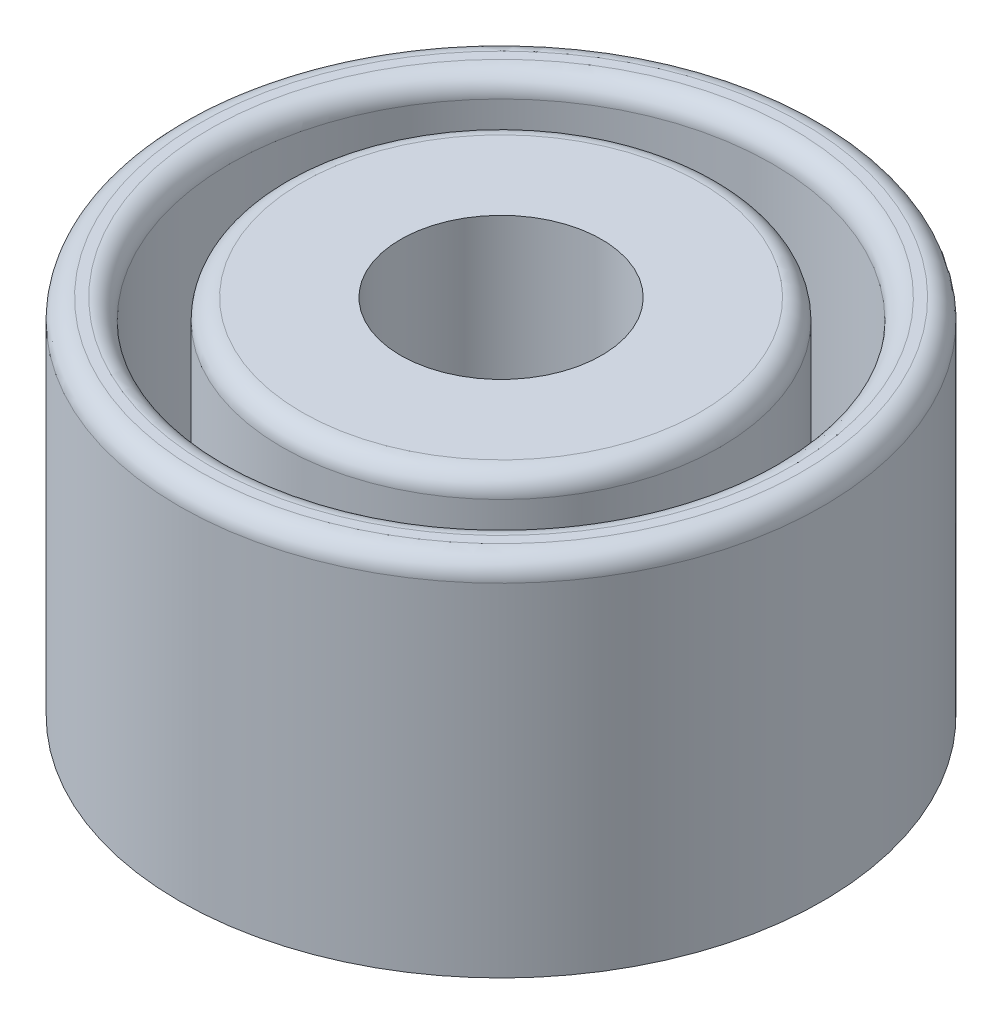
from build123d import *

# Parameters (mm, degrees)
SKETCH_1_R          = 16
EXTRUDE_1_DEPTH     = 18
SKETCH_2_R          = 13.5
SKETCH_2_R_2        = 10.9
SKETCH_2_R_3        = 5
CUT_EXTRUDE_1_DEPTH = 14
CUT_EXTRUDE_2_DEPTH = 1
FILLET_1_R          = 1


with BuildPart() as part:
    # Sketch 1 → Extrude 1 (new body)
    with BuildSketch(Plane(origin=(0, 0, 0), x_dir=(1, 0, 0), z_dir=(0, 1, 0))):
        with Locations(Location((0, 0, 0), (0, 0, 270))):
            Circle(SKETCH_1_R)
    extrude(amount=EXTRUDE_1_DEPTH)

    # Sketch 2 → Cut-Extrude 1 (cut)
    # profile 1 of 2: a face of its own
    with BuildSketch(Plane(origin=(0, 18, 0), x_dir=(1, 0, 0), z_dir=(0, 1, 0))):
        with Locations(Location((0, 0, 0), (0, 0, 270))):
            Circle(SKETCH_2_R)
        with Locations(Location((0, 0, 0), (0, 0, 270))):
            Circle(SKETCH_2_R_2, mode=Mode.SUBTRACT)
    # profile 2 of 2: a face of its own
    with BuildSketch(Plane(origin=(0, 18, 0), x_dir=(1, 0, 0), z_dir=(0, 1, 0))):
        with Locations(Location((0, 0, 0), (0, 0, 270))):
            Circle(SKETCH_2_R_3)
    extrude(amount=-CUT_EXTRUDE_1_DEPTH, mode=Mode.SUBTRACT)

    # Sketch 3 → Cut-Extrude 2 (cut)
    with BuildSketch(Plane.XZ):
        with BuildLine():
            Line((0, -5.25), (0, -6.600740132))
            Line((0, -6.600740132), (-3.769736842, -9.001233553))
            add(Edge.make_bspline(
                [(-3.769736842, -9.001233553), (-3.821474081, -9.033829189), (-3.917540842, -9.094353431), (-4.051706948, -9.176624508), (-4.166594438, -9.240717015), (-4.236771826, -9.277271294), (-4.268092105, -9.293585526)],
                knots=[0, 0, 0, 0, 1.269529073, 2.357287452, 3.266854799, 4, 4, 4, 4], degree=3))
            Line((-4.268092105, -9.293585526), (-4.268092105, -9.309621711))
            add(Edge.make_bspline(
                [(-4.268092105, -9.309621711), (-4.239722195, -9.307146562), (-4.17971652, -9.301911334), (-4.084407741, -9.293770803), (-3.978610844, -9.289964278), (-3.86270089, -9.284435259), (-3.736446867, -9.280864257), (-3.599505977, -9.278909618), (-3.451904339, -9.275594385), (-3.349919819, -9.276070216), (-3.297286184, -9.276315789)],
                knots=[0, 0, 0, 0, 0.703373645, 1.487717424, 2.362034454, 3.317515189, 4.353823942, 5.481267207, 6.700096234, 8, 8, 8, 8], degree=3))
            Line((-3.297286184, -9.276315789), (0, -9.276315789))
            Line((0, -9.276315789), (0, -10.539473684))
            Line((0, -10.539473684), (-6, -10.539473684))
            Line((-6, -10.539473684), (-6, -9.097450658))
            Line((-6, -9.097450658), (-2.347450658, -6.788240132))
            add(Edge.make_bspline(
                [(-2.347450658, -6.788240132), (-2.266014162, -6.737012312), (-2.105045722, -6.635754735), (-1.93951591, -6.542141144), (-1.857730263, -6.495888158)],
                knots=[0, 0, 0, 0, 1.011831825, 2, 2, 2, 2], degree=3))
            Line((-1.857730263, -6.495888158), (-1.857730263, -6.479851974))
            add(Edge.make_bspline(
                [(-1.857730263, -6.479851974), (-1.877460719, -6.482358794), (-1.92056861, -6.487835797), (-1.99201853, -6.495953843), (-2.076078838, -6.499539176), (-2.17305805, -6.505189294), (-2.2820557, -6.508591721), (-2.404193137, -6.510630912), (-2.538637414, -6.51388283), (-2.632810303, -6.513405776), (-2.681743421, -6.513157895)],
                knots=[0, 0, 0, 0, 0.578461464, 1.263845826, 2.090348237, 3.024315, 4.089200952, 5.261350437, 6.576971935, 8, 8, 8, 8], degree=3))
            Line((-2.681743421, -6.513157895), (-6, -6.513157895))
            Line((-6, -6.513157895), (-6, -5.25))
            Line((-6, -5.25), (0, -5.25))
        make_face()
        with BuildLine():
            add(Edge.make_bspline(
                [(-0.244243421, 0.434210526), (-0.218442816, 0.377774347), (-0.165862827, 0.262761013), (-0.098923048, 0.080424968), (-0.044282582, -0.114886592), (0.0018114, -0.322341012), (0.035261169, -0.542951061), (0.06164173, -0.775366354), (0.076193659, -1.020783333), (0.07801357, -1.188304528), (0.078947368, -1.274259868)],
                knots=[0, 0, 0, 0, 0.849106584, 1.730425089, 2.654956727, 3.623062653, 4.637105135, 5.707279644, 6.823602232, 8, 8, 8, 8], degree=3))
            add(Edge.make_bspline(
                [(0.078947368, -1.274259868), (0.076832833, -1.385811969), (0.07270758, -1.603439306), (0.033187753, -1.920769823), (-0.028708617, -2.219901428), (-0.116466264, -2.501209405), (-0.230330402, -2.763710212), (-0.368906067, -3.008708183), (-0.534128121, -3.234320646), (-0.723288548, -3.44011453), (-0.932237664, -3.625519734), (-1.161212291, -3.784785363), (-1.40478987, -3.921796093), (-1.666665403, -4.031698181), (-1.944673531, -4.118074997), (-2.239616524, -4.17916057), (-2.550819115, -4.217067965), (-2.763868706, -4.221443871), (-2.872944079, -4.223684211)],
                knots=[0, 0, 0, 0, 1.134415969, 2.213135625, 3.24770366, 4.238660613, 5.205402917, 6.153363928, 7.096327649, 8.043780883, 8.992175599, 9.932202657, 10.876056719, 11.83016335, 12.815879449, 13.833211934, 14.890665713, 16, 16, 16, 16], degree=3))
            add(Edge.make_bspline(
                [(-2.872944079, -4.223684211), (-2.989444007, -4.22131296), (-3.217477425, -4.216671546), (-3.550625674, -4.173464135), (-3.866979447, -4.104709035), (-4.167057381, -4.008846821), (-4.449643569, -3.883460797), (-4.71572095, -3.730843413), (-4.964439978, -3.549841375), (-5.194327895, -3.342852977), (-5.402717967, -3.114562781), (-5.583344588, -2.866252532), (-5.73756366, -2.602513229), (-5.862186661, -2.321747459), (-5.960619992, -2.025255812), (-6.028441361, -1.711758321), (-6.072003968, -1.381983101), (-6.076599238, -1.156392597), (-6.078947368, -1.041118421)],
                knots=[0, 0, 0, 0, 1.100430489, 2.15394918, 3.168365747, 4.156295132, 5.125222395, 6.084283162, 7.0495575, 8.026306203, 9.002776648, 9.964909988, 10.922552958, 11.884380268, 12.862434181, 13.869261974, 14.91121716, 16, 16, 16, 16], degree=3))
            add(Edge.make_bspline(
                [(-6.078947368, -1.041118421), (-6.07831079, -0.969553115), (-6.077062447, -0.829212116), (-6.065098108, -0.623148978), (-6.049104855, -0.425415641), (-6.022280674, -0.236725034), (-5.991098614, -0.05619909), (-5.950914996, 0.1151896), (-5.906716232, 0.278991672), (-5.868359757, 0.383058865), (-5.849506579, 0.434210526)],
                knots=[0, 0, 0, 0, 1.144105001, 2.243612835, 3.299526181, 4.314830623, 5.289785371, 6.227522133, 7.128782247, 8, 8, 8, 8], degree=3))
            Line((-5.849506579, 0.434210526), (-4.5, 0.434210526))
            add(Edge.make_bspline(
                [(-4.5, 0.434210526), (-4.531592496, 0.383662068), (-4.594287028, 0.283349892), (-4.674824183, 0.125403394), (-4.742621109, -0.037570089), (-4.798516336, -0.206160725), (-4.841367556, -0.379862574), (-4.872344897, -0.55872893), (-4.891266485, -0.74259975), (-4.893571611, -0.867142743), (-4.894736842, -0.930098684)],
                knots=[0, 0, 0, 0, 0.992495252, 1.969582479, 2.948947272, 3.930034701, 4.92500798, 5.925973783, 6.951588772, 8, 8, 8, 8], degree=3))
            add(Edge.make_bspline(
                [(-4.894736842, -0.930098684), (-4.89291721, -0.998414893), (-4.889354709, -1.132165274), (-4.866188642, -1.328057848), (-4.825266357, -1.513855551), (-4.768707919, -1.68961375), (-4.695708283, -1.855380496), (-4.60469642, -2.009666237), (-4.499555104, -2.155578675), (-4.377517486, -2.289171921), (-4.242040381, -2.410651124), (-4.093290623, -2.515085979), (-3.934179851, -2.605889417), (-3.761833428, -2.67594875), (-3.579304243, -2.733683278), (-3.385120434, -2.774080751), (-3.179431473, -2.797294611), (-3.038710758, -2.800824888), (-2.966694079, -2.802631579)],
                knots=[0, 0, 0, 0, 1.081164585, 2.116718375, 3.11614911, 4.087453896, 5.034254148, 5.976211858, 6.917270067, 7.875451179, 8.834118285, 9.791039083, 10.746697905, 11.726790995, 12.729098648, 13.773062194, 14.860319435, 16, 16, 16, 16], degree=3))
            add(Edge.make_bspline(
                [(-2.966694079, -2.802631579), (-2.897528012, -2.80146082), (-2.762477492, -2.799174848), (-2.565548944, -2.774035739), (-2.378247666, -2.739023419), (-2.202921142, -2.683361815), (-2.03728492, -2.616268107), (-1.883704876, -2.531647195), (-1.740921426, -2.432122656), (-1.608883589, -2.31904717), (-1.490384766, -2.192128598), (-1.387823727, -2.052957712), (-1.299668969, -1.904435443), (-1.227246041, -1.74545986), (-1.17350877, -1.574941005), (-1.134534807, -1.394480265), (-1.108536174, -1.203463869), (-1.106371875, -1.072457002), (-1.105263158, -1.005345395)],
                knots=[0, 0, 0, 0, 1.13522519, 2.216589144, 3.256220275, 4.260124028, 5.232038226, 6.187054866, 7.133075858, 8.086013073, 9.036842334, 9.978224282, 10.91979998, 11.868780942, 12.840483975, 13.849824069, 14.898517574, 16, 16, 16, 16], degree=3))
            add(Edge.make_bspline(
                [(-1.105263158, -1.005345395), (-1.106415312, -0.94033261), (-1.108695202, -0.81168491), (-1.127901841, -0.620889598), (-1.158404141, -0.434557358), (-1.201881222, -0.252413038), (-1.257443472, -0.074321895), (-1.325695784, 0.099885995), (-1.405192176, 0.270609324), (-1.468327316, 0.379555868), (-1.5, 0.434210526)],
                knots=[0, 0, 0, 0, 1.032108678, 2.042343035, 3.041652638, 4.028254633, 5.013278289, 6.001434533, 6.997389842, 8, 8, 8, 8], degree=3))
            Line((-1.5, 0.434210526), (-0.244243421, 0.434210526))
        make_face()
        with BuildLine():
            Line((0, 6.355263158), (0, 4.6875))
            Line((0, 4.6875), (-2.606496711, 2.979029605))
            add(Edge.make_bspline(
                [(-2.606496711, 2.979029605), (-2.622823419, 2.969347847), (-2.661621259, 2.946340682), (-2.733968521, 2.912323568), (-2.82748482, 2.869448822), (-2.8983315, 2.839813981), (-2.937088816, 2.823601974)],
                knots=[0, 0, 0, 0, 0.622718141, 1.47979111, 2.621296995, 4, 4, 4, 4], degree=3))
            Line((-2.937088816, 2.823601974), (-2.937088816, 2.802631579))
            Line((-2.937088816, 2.802631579), (0, 2.802631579))
            Line((0, 2.802631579), (0, 1.460526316))
            Line((0, 1.460526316), (-6, 1.460526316))
            Line((-6, 1.460526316), (-6, 2.802631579))
            Line((-6, 2.802631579), (-3.162828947, 2.802631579))
            Line((-3.162828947, 2.802631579), (-3.162828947, 2.823601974))
            add(Edge.make_bspline(
                [(-3.162828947, 2.823601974), (-3.184711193, 2.83286256), (-3.232680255, 2.853163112), (-3.309522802, 2.891248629), (-3.399081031, 2.936630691), (-3.463026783, 2.969916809), (-3.497121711, 2.987664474)],
                knots=[0, 0, 0, 0, 0.765311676, 1.677674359, 2.761770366, 4, 4, 4, 4], degree=3))
            Line((-3.497121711, 2.987664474), (-6, 4.614720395))
            Line((-6, 4.614720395), (-6, 6.197368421))
            Line((-6, 6.197368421), (-3.138157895, 4.134868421))
            Line((-3.138157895, 4.134868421), (0, 6.355263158))
        make_face()
        with BuildLine():
            add(Edge.make_bspline(
                [(-2.612664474, 11.802631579), (-2.504055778, 11.800707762), (-2.29343936, 11.796977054), (-1.987342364, 11.769079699), (-1.702451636, 11.719813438), (-1.437883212, 11.652768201), (-1.195047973, 11.564929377), (-0.972362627, 11.459091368), (-0.771021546, 11.332575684), (-0.590535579, 11.186584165), (-0.432657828, 11.019137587), (-0.295084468, 10.833243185), (-0.178481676, 10.627800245), (-0.082984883, 10.403163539), (-0.011459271, 10.158592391), (0.042116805, 9.895877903), (0.072337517, 9.613367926), (0.076698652, 9.418655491), (0.078947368, 9.318256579)],
                knots=[0, 0, 0, 0, 1.240965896, 2.406508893, 3.508007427, 4.541607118, 5.521066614, 6.45412441, 7.353584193, 8.2319471, 9.099384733, 9.976137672, 10.868364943, 11.792543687, 12.758762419, 13.775121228, 14.852793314, 16, 16, 16, 16], degree=3))
            add(Edge.make_bspline(
                [(0.078947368, 9.318256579), (0.077269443, 9.220721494), (0.074017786, 9.031707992), (0.042815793, 8.757608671), (-0.008805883, 8.502525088), (-0.079496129, 8.265587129), (-0.172799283, 8.047568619), (-0.286295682, 7.848270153), (-0.420145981, 7.667264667), (-0.576515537, 7.507475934), (-0.751037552, 7.364087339), (-0.948098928, 7.241808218), (-1.165395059, 7.138075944), (-1.403058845, 7.053100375), (-1.661378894, 6.988217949), (-1.93944245, 6.942121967), (-2.237884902, 6.913342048), (-2.443599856, 6.909748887), (-2.549753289, 6.907894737)],
                knots=[0, 0, 0, 0, 1.144458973, 2.217850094, 3.232498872, 4.195865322, 5.114744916, 6.009675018, 6.882255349, 7.749171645, 8.627299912, 9.52716151, 10.464002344, 11.448651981, 12.484575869, 13.585846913, 14.754243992, 16, 16, 16, 16], degree=3))
            Line((-2.549753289, 6.907894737), (-6, 6.907894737))
            Line((-6, 6.907894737), (-6, 8.25))
            Line((-6, 8.25), (-2.548519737, 8.25))
            add(Edge.make_bspline(
                [(-2.548519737, 8.25), (-2.49011316, 8.251110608), (-2.377279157, 8.25325616), (-2.213228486, 8.265092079), (-2.060697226, 8.287011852), (-1.91949146, 8.318204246), (-1.788930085, 8.355505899), (-1.670086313, 8.403940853), (-1.562034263, 8.460669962), (-1.465137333, 8.525907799), (-1.380262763, 8.600695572), (-1.307109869, 8.684405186), (-1.242986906, 8.775874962), (-1.193130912, 8.877862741), (-1.15324921, 8.987395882), (-1.124614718, 9.105648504), (-1.109313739, 9.232739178), (-1.106635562, 9.320274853), (-1.105263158, 9.365131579)],
                knots=[0, 0, 0, 0, 1.346438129, 2.601145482, 3.788760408, 4.894951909, 5.932630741, 6.914756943, 7.847529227, 8.741349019, 9.600891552, 10.447056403, 11.298882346, 12.16783213, 13.055347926, 13.981790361, 14.965789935, 16, 16, 16, 16], degree=3))
            add(Edge.make_bspline(
                [(-1.105263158, 9.365131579), (-1.105879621, 9.409615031), (-1.107072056, 9.495660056), (-1.125687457, 9.620201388), (-1.151821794, 9.736662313), (-1.19030576, 9.844144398), (-1.238654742, 9.9436704), (-1.299605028, 10.033504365), (-1.37037639, 10.115930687), (-1.452715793, 10.189634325), (-1.546802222, 10.25279067), (-1.650455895, 10.309638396), (-1.765987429, 10.355515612), (-1.891483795, 10.39541491), (-2.028306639, 10.424565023), (-2.175516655, 10.444785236), (-2.333595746, 10.45929661), (-2.44280982, 10.460107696), (-2.499177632, 10.460526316)],
                knots=[0, 0, 0, 0, 1.053179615, 2.037181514, 2.97796347, 3.877990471, 4.736544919, 5.593327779, 6.443154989, 7.305847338, 8.203232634, 9.123295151, 10.10231424, 11.144070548, 12.241236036, 13.412662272, 14.66461747, 16, 16, 16, 16], degree=3))
            Line((-2.499177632, 10.460526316), (-6, 10.460526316))
            Line((-6, 10.460526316), (-6, 11.802631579))
            Line((-6, 11.802631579), (-2.612664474, 11.802631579))
        make_face()
        Polygon((9, -0.184210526), (9, -4.328947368), (2, -4.328947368), (2, -0.368421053), (3.289473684, -0.368421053), (3.289473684, -2.763157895), (4.855263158, -2.763157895), (4.855263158, -0.552631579), (6.144736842, -0.552631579), (6.144736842, -2.763157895), (7.710526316, -2.763157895), (7.710526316, -0.184210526), align=None)
        with BuildLine():
            Line((8.704975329, 0.644736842), (7.157894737, 0.644736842))
            add(Edge.make_bspline(
                [(7.157894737, 0.644736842), (7.216818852, 0.716634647), (7.333296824, 0.858758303), (7.482739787, 1.087730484), (7.610788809, 1.324720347), (7.713511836, 1.570480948), (7.794668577, 1.821292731), (7.851670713, 2.074211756), (7.888206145, 2.328430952), (7.892557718, 2.498233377), (7.894736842, 2.583264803)],
                knots=[0, 0, 0, 0, 1.052804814, 2.08112707, 3.092934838, 4.101597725, 5.095309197, 6.076510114, 7.036780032, 8, 8, 8, 8], degree=3))
            add(Edge.make_bspline(
                [(7.894736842, 2.583264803), (7.894514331, 2.631749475), (7.894084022, 2.725512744), (7.881475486, 2.860882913), (7.865125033, 2.986985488), (7.840243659, 3.103662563), (7.810643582, 3.211590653), (7.774374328, 3.310196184), (7.733222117, 3.399699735), (7.685194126, 3.479299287), (7.63357633, 3.549510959), (7.578832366, 3.612236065), (7.516159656, 3.661586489), (7.430700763, 3.717764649), (7.311082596, 3.765489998), (7.210176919, 3.772688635), (7.159333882, 3.776315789)],
                knots=[0, 0, 0, 0, 1.303156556, 2.520141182, 3.653067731, 4.720733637, 5.725444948, 6.66005054, 7.543018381, 8.370431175, 9.154790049, 9.885436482, 10.600660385, 11.291262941, 12.635156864, 14, 14, 14, 14], degree=3))
            add(Edge.make_bspline(
                [(7.159333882, 3.776315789), (7.126128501, 3.77495414), (7.060904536, 3.772279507), (6.965662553, 3.75044061), (6.877181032, 3.711565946), (6.792917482, 3.661387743), (6.715008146, 3.595856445), (6.638931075, 3.521737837), (6.566502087, 3.435719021), (6.472723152, 3.303147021), (6.359490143, 3.112125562), (6.232514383, 2.85453862), (6.108198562, 2.567044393), (6.025036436, 2.367016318), (5.982113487, 2.263774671)],
                knots=[0, 0, 0, 0, 0.590885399, 1.160651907, 1.727015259, 2.305611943, 2.900557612, 3.534735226, 4.19528236, 4.899241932, 6.424096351, 8.142971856, 10.009249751, 12, 12, 12, 12], degree=3))
            add(Edge.make_bspline(
                [(5.982113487, 2.263774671), (5.953308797, 2.197850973), (5.897102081, 2.069213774), (5.806706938, 1.883352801), (5.708791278, 1.712138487), (5.608394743, 1.552126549), (5.501375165, 1.407433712), (5.391857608, 1.272975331), (5.275816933, 1.153229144), (5.155671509, 1.045183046), (5.029348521, 0.950988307), (4.897100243, 0.86882637), (4.758381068, 0.799363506), (4.613193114, 0.743155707), (4.462156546, 0.698310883), (4.304186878, 0.666767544), (4.140006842, 0.647627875), (4.028286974, 0.645709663), (3.971628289, 0.644736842)],
                knots=[0, 0, 0, 0, 1.250796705, 2.440685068, 3.591069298, 4.678537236, 5.722832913, 6.718116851, 7.691385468, 8.618832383, 9.52461204, 10.427275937, 11.322472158, 12.217707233, 13.130829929, 14.058276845, 15.015255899, 16, 16, 16, 16], degree=3))
            add(Edge.make_bspline(
                [(3.971628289, 0.644736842), (3.884161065, 0.647547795), (3.714964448, 0.652985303), (3.470058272, 0.693557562), (3.244142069, 0.762083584), (3.038183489, 0.859860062), (2.85081954, 0.980829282), (2.680714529, 1.121933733), (2.528154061, 1.283795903), (2.393022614, 1.46413698), (2.274830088, 1.66212224), (2.174623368, 1.876168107), (2.089160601, 2.104094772), (2.022369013, 2.346581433), (1.971028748, 2.599617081), (1.936017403, 2.861724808), (1.911454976, 3.130153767), (1.909088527, 3.311895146), (1.907894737, 3.403577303)],
                knots=[0, 0, 0, 0, 1.081193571, 2.091461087, 3.059615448, 3.990964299, 4.900853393, 5.810703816, 6.717028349, 7.644743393, 8.591826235, 9.562956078, 10.5633717, 11.598156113, 12.669558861, 13.753385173, 14.866661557, 16, 16, 16, 16], degree=3))
            add(Edge.make_bspline(
                [(1.907894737, 3.403577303), (1.908815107, 3.492335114), (1.910601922, 3.664650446), (1.921761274, 3.915750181), (1.941909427, 4.150949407), (1.969110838, 4.372368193), (2.004945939, 4.581826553), (2.050207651, 4.78179614), (2.100446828, 4.974253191), (2.144014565, 5.09723942), (2.165501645, 5.157894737)],
                knots=[0, 0, 0, 0, 1.195237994, 2.320447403, 3.383723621, 4.373269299, 5.323774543, 6.243759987, 7.133843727, 8, 8, 8, 8], degree=3))
            Line((2.165501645, 5.157894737), (3.565789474, 5.157894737))
            add(Edge.make_bspline(
                [(3.565789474, 5.157894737), (3.528603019, 5.097149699), (3.452620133, 4.973029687), (3.360186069, 4.771972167), (3.279054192, 4.561127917), (3.215735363, 4.343136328), (3.164500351, 4.12323704), (3.131156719, 3.905194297), (3.110005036, 3.693260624), (3.106819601, 3.554733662), (3.105263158, 3.487047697)],
                knots=[0, 0, 0, 0, 0.973185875, 1.988505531, 3.020409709, 4.060289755, 5.089876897, 6.105810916, 7.074476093, 8, 8, 8, 8], degree=3))
            add(Edge.make_bspline(
                [(3.105263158, 3.487047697), (3.107437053, 3.401016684), (3.111616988, 3.235597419), (3.151577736, 3.00170206), (3.215885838, 2.797460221), (3.29945015, 2.623674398), (3.407526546, 2.485913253), (3.513238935, 2.397223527), (3.607135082, 2.348052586), (3.681536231, 2.322931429), (3.759800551, 2.305891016), (3.813229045, 2.303737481), (3.840666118, 2.302631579)],
                knots=[0, 0, 0, 0, 1.666466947, 3.204260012, 4.580445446, 5.807128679, 6.919489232, 7.950533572, 8.453750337, 8.965400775, 9.468703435, 10, 10, 10, 10], degree=3))
            add(Edge.make_bspline(
                [(3.840666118, 2.302631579), (3.869055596, 2.303709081), (3.924939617, 2.305830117), (4.006087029, 2.323427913), (4.082537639, 2.352985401), (4.181098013, 2.408632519), (4.296810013, 2.508305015), (4.42456081, 2.661991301), (4.544665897, 2.85333127), (4.663296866, 3.079594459), (4.783360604, 3.338599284), (4.860708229, 3.523706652), (4.901315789, 3.620888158)],
                knots=[0, 0, 0, 0, 0.477015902, 0.938994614, 1.388407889, 1.850668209, 2.83597041, 3.934910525, 5.201350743, 6.626749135, 8.229040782, 10, 10, 10, 10], degree=3))
            add(Edge.make_bspline(
                [(4.901315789, 3.620888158), (4.929993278, 3.688791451), (4.986390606, 3.822330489), (5.079413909, 4.014426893), (5.172117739, 4.197501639), (5.268795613, 4.36988087), (5.370201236, 4.530984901), (5.478634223, 4.679834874), (5.592561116, 4.816810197), (5.711831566, 4.943407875), (5.840685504, 5.055823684), (5.977036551, 5.156134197), (6.124065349, 5.239402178), (6.279112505, 5.310939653), (6.44565307, 5.368019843), (6.625551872, 5.405282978), (6.817499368, 5.431270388), (6.950083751, 5.433211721), (7.018297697, 5.434210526)],
                knots=[0, 0, 0, 0, 1.18199248, 2.324513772, 3.422167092, 4.472869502, 5.493130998, 6.473417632, 7.424028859, 8.349141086, 9.259645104, 10.163002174, 11.059089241, 11.96454075, 12.898821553, 13.8752056, 14.906804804, 16, 16, 16, 16], degree=3))
            add(Edge.make_bspline(
                [(7.018297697, 5.434210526), (7.1115377, 5.431570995), (7.291340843, 5.426480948), (7.548949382, 5.384242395), (7.78410202, 5.31635151), (7.994487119, 5.216335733), (8.184789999, 5.094598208), (8.355171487, 4.951506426), (8.50639111, 4.788182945), (8.638834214, 4.606355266), (8.752415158, 4.406454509), (8.848689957, 4.191344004), (8.928410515, 3.960742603), (8.989019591, 3.715768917), (9.033615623, 3.459167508), (9.069462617, 3.195285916), (9.087156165, 2.923625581), (9.090442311, 2.740630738), (9.092105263, 2.648026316)],
                knots=[0, 0, 0, 0, 1.135952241, 2.19055959, 3.172983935, 4.109504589, 5.019506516, 5.920217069, 6.813972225, 7.72628221, 8.656133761, 9.611470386, 10.5953034, 11.62638373, 12.683953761, 13.769037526, 14.871022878, 16, 16, 16, 16], degree=3))
            add(Edge.make_bspline(
                [(9.092105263, 2.648026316), (9.091168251, 2.552529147), (9.089320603, 2.364223), (9.069575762, 2.085265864), (9.039601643, 1.81349344), (8.998937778, 1.549990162), (8.944432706, 1.299180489), (8.879113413, 1.064144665), (8.800143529, 0.846574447), (8.736209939, 0.710980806), (8.704975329, 0.644736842)],
                knots=[0, 0, 0, 0, 1.113719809, 2.196089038, 3.260137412, 4.302409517, 5.30443291, 6.252114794, 7.146074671, 8, 8, 8, 8], degree=3))
        make_face()
    extrude(amount=-CUT_EXTRUDE_2_DEPTH, mode=Mode.SUBTRACT)

    # Fillet 1
    fillet_1_edges = [part.edges().sort_by_distance(p)[0] for p in [
        (0, 18, -16),
        (0, 18, -10.9),
        (0, 18, -13.5),
    ]]
    fillet(fillet_1_edges, radius=FILLET_1_R)


solid = part.part
